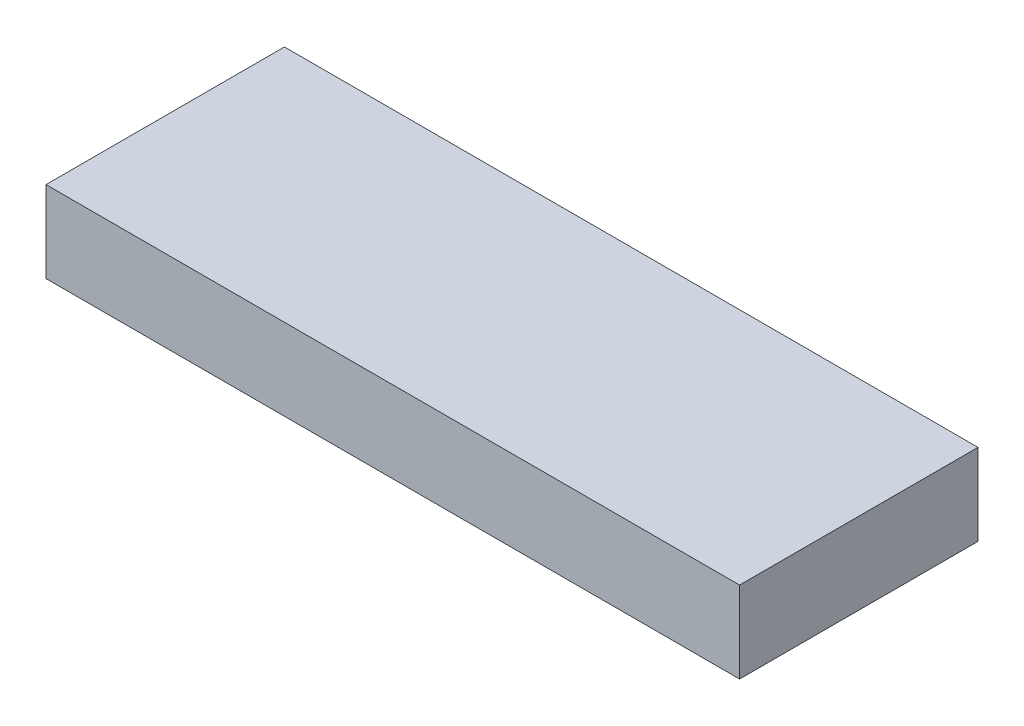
ISO-10303-21;
HEADER;
FILE_DESCRIPTION(('STEP AP214'),'2;1');
FILE_NAME('part.step','',(''),(''),'','','');
FILE_SCHEMA(('AUTOMOTIVE_DESIGN { 1 0 10303 214 1 1 1 1 }'));
ENDSEC;
DATA;
#1=APPLICATION_CONTEXT('core data for automotive mechanical design processes');
#2=APPLICATION_PROTOCOL_DEFINITION('international standard','automotive_design',2000,#1);
#3=PRODUCT_CONTEXT('',#1,'mechanical');
#4=PRODUCT('Part','Part','',(#3));
#5=PRODUCT_RELATED_PRODUCT_CATEGORY('part','',(#4));
#6=PRODUCT_DEFINITION_FORMATION('','',#4);
#7=PRODUCT_DEFINITION_CONTEXT('part definition',#1,'design');
#8=PRODUCT_DEFINITION('design','',#6,#7);
#9=PRODUCT_DEFINITION_SHAPE('','',#8);
#10=(LENGTH_UNIT() NAMED_UNIT(*) SI_UNIT(.MILLI.,.METRE.));
#11=(NAMED_UNIT(*) PLANE_ANGLE_UNIT() SI_UNIT($,.RADIAN.));
#12=(NAMED_UNIT(*) SI_UNIT($,.STERADIAN.) SOLID_ANGLE_UNIT());
#13=UNCERTAINTY_MEASURE_WITH_UNIT(LENGTH_MEASURE(1.E-05),#10,'distance_accuracy_value','');
#14=(GEOMETRIC_REPRESENTATION_CONTEXT(3) GLOBAL_UNCERTAINTY_ASSIGNED_CONTEXT((#13)) GLOBAL_UNIT_ASSIGNED_CONTEXT((#10,
#11,#12)) REPRESENTATION_CONTEXT('',''));
#15=CARTESIAN_POINT('',(0.,0.,0.));
#16=DIRECTION('',(0.,0.,1.));
#17=DIRECTION('',(1.,0.,0.));
#18=AXIS2_PLACEMENT_3D('',#15,#16,#17);
#19=CARTESIAN_POINT('',(812.8,190.833959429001,-279.4));
#20=DIRECTION('',(-1.,0.,0.));
#21=DIRECTION('',(0.,0.,1.));
#22=AXIS2_PLACEMENT_3D('',#19,#20,#21);
#23=PLANE('',#22);
#24=DIRECTION('',(0.,0.,-1.));
#25=VECTOR('',#24,1.);
#26=CARTESIAN_POINT('',(812.8,0.,-279.4));
#27=LINE('',#26,#25);
#28=CARTESIAN_POINT('',(812.8,0.,279.4));
#29=VERTEX_POINT('',#28);
#30=CARTESIAN_POINT('',(812.8,0.,-279.4));
#31=VERTEX_POINT('',#30);
#32=EDGE_CURVE('E100',#29,#31,#27,.T.);
#33=ORIENTED_EDGE('',*,*,#32,.T.);
#34=DIRECTION('',(0.,-1.,0.));
#35=VECTOR('',#34,1.);
#36=CARTESIAN_POINT('',(812.8,190.833959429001,-279.4));
#37=LINE('',#36,#35);
#38=CARTESIAN_POINT('',(812.8,190.833959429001,-279.4));
#39=VERTEX_POINT('',#38);
#40=EDGE_CURVE('E11',#39,#31,#37,.T.);
#41=ORIENTED_EDGE('',*,*,#40,.F.);
#42=DIRECTION('',(0.,0.,-1.));
#43=VECTOR('',#42,1.);
#44=CARTESIAN_POINT('',(812.8,190.833959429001,-279.4));
#45=LINE('',#44,#43);
#46=CARTESIAN_POINT('',(812.8,190.833959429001,279.4));
#47=VERTEX_POINT('',#46);
#48=EDGE_CURVE('E88',#47,#39,#45,.T.);
#49=ORIENTED_EDGE('',*,*,#48,.F.);
#50=DIRECTION('',(0.,-1.,0.));
#51=VECTOR('',#50,1.);
#52=CARTESIAN_POINT('',(812.8,190.833959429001,279.4));
#53=LINE('',#52,#51);
#54=EDGE_CURVE('E96',#47,#29,#53,.T.);
#55=ORIENTED_EDGE('',*,*,#54,.T.);
#56=EDGE_LOOP('',(#33,#41,#49,#55));
#57=FACE_BOUND('',#56,.T.);
#58=ADVANCED_FACE('F37',(#57),#23,.F.);
#59=CARTESIAN_POINT('',(-812.8,190.833959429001,-279.4));
#60=DIRECTION('',(0.,0.,1.));
#61=DIRECTION('',(1.,0.,0.));
#62=AXIS2_PLACEMENT_3D('',#59,#60,#61);
#63=PLANE('',#62);
#64=DIRECTION('',(-1.,0.,0.));
#65=VECTOR('',#64,1.);
#66=CARTESIAN_POINT('',(-812.8,0.,-279.4));
#67=LINE('',#66,#65);
#68=CARTESIAN_POINT('',(-812.8,0.,-279.4));
#69=VERTEX_POINT('',#68);
#70=EDGE_CURVE('E92',#31,#69,#67,.T.);
#71=ORIENTED_EDGE('',*,*,#70,.T.);
#72=DIRECTION('',(0.,-1.,0.));
#73=VECTOR('',#72,1.);
#74=CARTESIAN_POINT('',(-812.8,190.833959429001,-279.4));
#75=LINE('',#74,#73);
#76=CARTESIAN_POINT('',(-812.8,190.833959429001,-279.4));
#77=VERTEX_POINT('',#76);
#78=EDGE_CURVE('E45',#77,#69,#75,.T.);
#79=ORIENTED_EDGE('',*,*,#78,.F.);
#80=DIRECTION('',(-1.,0.,0.));
#81=VECTOR('',#80,1.);
#82=CARTESIAN_POINT('',(-812.8,190.833959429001,-279.4));
#83=LINE('',#82,#81);
#84=EDGE_CURVE('E83',#39,#77,#83,.T.);
#85=ORIENTED_EDGE('',*,*,#84,.F.);
#86=ORIENTED_EDGE('',*,*,#40,.T.);
#87=EDGE_LOOP('',(#71,#79,#85,#86));
#88=FACE_BOUND('',#87,.T.);
#89=ADVANCED_FACE('F91',(#88),#63,.F.);
#90=CARTESIAN_POINT('',(-812.8,190.833959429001,-279.4));
#91=DIRECTION('',(1.,0.,0.));
#92=DIRECTION('',(0.,0.,-1.));
#93=AXIS2_PLACEMENT_3D('',#90,#91,#92);
#94=PLANE('',#93);
#95=DIRECTION('',(0.,0.,1.));
#96=VECTOR('',#95,1.);
#97=CARTESIAN_POINT('',(-812.8,0.,-279.4));
#98=LINE('',#97,#96);
#99=CARTESIAN_POINT('',(-812.8,0.,279.4));
#100=VERTEX_POINT('',#99);
#101=EDGE_CURVE('E70',#69,#100,#98,.T.);
#102=ORIENTED_EDGE('',*,*,#101,.T.);
#103=DIRECTION('',(0.,-1.,0.));
#104=VECTOR('',#103,1.);
#105=CARTESIAN_POINT('',(-812.8,190.833959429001,279.4));
#106=LINE('',#105,#104);
#107=CARTESIAN_POINT('',(-812.8,190.833959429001,279.4));
#108=VERTEX_POINT('',#107);
#109=EDGE_CURVE('E93',#108,#100,#106,.T.);
#110=ORIENTED_EDGE('',*,*,#109,.F.);
#111=DIRECTION('',(0.,0.,1.));
#112=VECTOR('',#111,1.);
#113=CARTESIAN_POINT('',(-812.8,190.833959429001,-279.4));
#114=LINE('',#113,#112);
#115=EDGE_CURVE('E86',#77,#108,#114,.T.);
#116=ORIENTED_EDGE('',*,*,#115,.F.);
#117=ORIENTED_EDGE('',*,*,#78,.T.);
#118=EDGE_LOOP('',(#102,#110,#116,#117));
#119=FACE_BOUND('',#118,.T.);
#120=ADVANCED_FACE('F94',(#119),#94,.F.);
#121=CARTESIAN_POINT('',(-812.8,190.833959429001,279.4));
#122=DIRECTION('',(0.,0.,-1.));
#123=DIRECTION('',(-1.,0.,0.));
#124=AXIS2_PLACEMENT_3D('',#121,#122,#123);
#125=PLANE('',#124);
#126=DIRECTION('',(1.,0.,0.));
#127=VECTOR('',#126,1.);
#128=CARTESIAN_POINT('',(-812.8,0.,279.4));
#129=LINE('',#128,#127);
#130=EDGE_CURVE('E76',#100,#29,#129,.T.);
#131=ORIENTED_EDGE('',*,*,#130,.T.);
#132=ORIENTED_EDGE('',*,*,#54,.F.);
#133=DIRECTION('',(1.,0.,0.));
#134=VECTOR('',#133,1.);
#135=CARTESIAN_POINT('',(-812.8,190.833959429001,279.4));
#136=LINE('',#135,#134);
#137=EDGE_CURVE('E53',#108,#47,#136,.T.);
#138=ORIENTED_EDGE('',*,*,#137,.F.);
#139=ORIENTED_EDGE('',*,*,#109,.T.);
#140=EDGE_LOOP('',(#131,#132,#138,#139));
#141=FACE_BOUND('',#140,.T.);
#142=ADVANCED_FACE('F107',(#141),#125,.F.);
#143=CARTESIAN_POINT('',(0.,190.833959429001,0.));
#144=DIRECTION('',(0.,1.,0.));
#145=DIRECTION('',(0.,0.,1.));
#146=AXIS2_PLACEMENT_3D('',#143,#144,#145);
#147=PLANE('',#146);
#148=ORIENTED_EDGE('',*,*,#48,.T.);
#149=ORIENTED_EDGE('',*,*,#84,.T.);
#150=ORIENTED_EDGE('',*,*,#115,.T.);
#151=ORIENTED_EDGE('',*,*,#137,.T.);
#152=EDGE_LOOP('',(#148,#149,#150,#151));
#153=FACE_BOUND('',#152,.T.);
#154=ADVANCED_FACE('F84',(#153),#147,.T.);
#155=CARTESIAN_POINT('',(0.,0.,0.));
#156=DIRECTION('',(0.,1.,0.));
#157=DIRECTION('',(0.,0.,1.));
#158=AXIS2_PLACEMENT_3D('',#155,#156,#157);
#159=PLANE('',#158);
#160=ORIENTED_EDGE('',*,*,#32,.F.);
#161=ORIENTED_EDGE('',*,*,#130,.F.);
#162=ORIENTED_EDGE('',*,*,#101,.F.);
#163=ORIENTED_EDGE('',*,*,#70,.F.);
#164=EDGE_LOOP('',(#160,#161,#162,#163));
#165=FACE_BOUND('',#164,.T.);
#166=ADVANCED_FACE('F110',(#165),#159,.F.);
#167=CLOSED_SHELL('',(#58,#89,#120,#142,#154,#166));
#168=MANIFOLD_SOLID_BREP('B2',#167);
#169=ADVANCED_BREP_SHAPE_REPRESENTATION('',(#18,#168),#14);
#170=SHAPE_DEFINITION_REPRESENTATION(#9,#169);
ENDSEC;
END-ISO-10303-21;
